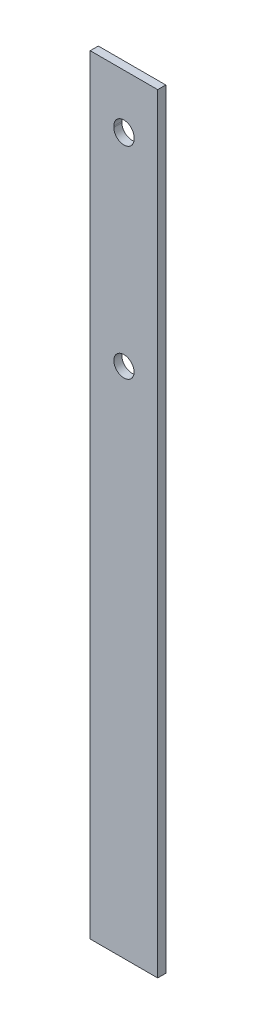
ISO-10303-21;
HEADER;
FILE_DESCRIPTION(('STEP AP214'),'2;1');
FILE_NAME('part.step','',(''),(''),'','','');
FILE_SCHEMA(('AUTOMOTIVE_DESIGN { 1 0 10303 214 1 1 1 1 }'));
ENDSEC;
DATA;
#1=APPLICATION_CONTEXT('core data for automotive mechanical design processes');
#2=APPLICATION_PROTOCOL_DEFINITION('international standard','automotive_design',2000,#1);
#3=PRODUCT_CONTEXT('',#1,'mechanical');
#4=PRODUCT('Part','Part','',(#3));
#5=PRODUCT_RELATED_PRODUCT_CATEGORY('part','',(#4));
#6=PRODUCT_DEFINITION_FORMATION('','',#4);
#7=PRODUCT_DEFINITION_CONTEXT('part definition',#1,'design');
#8=PRODUCT_DEFINITION('design','',#6,#7);
#9=PRODUCT_DEFINITION_SHAPE('','',#8);
#10=(LENGTH_UNIT() NAMED_UNIT(*) SI_UNIT(.MILLI.,.METRE.));
#11=(NAMED_UNIT(*) PLANE_ANGLE_UNIT() SI_UNIT($,.RADIAN.));
#12=(NAMED_UNIT(*) SI_UNIT($,.STERADIAN.) SOLID_ANGLE_UNIT());
#13=UNCERTAINTY_MEASURE_WITH_UNIT(LENGTH_MEASURE(1.E-05),#10,'distance_accuracy_value','');
#14=(GEOMETRIC_REPRESENTATION_CONTEXT(3) GLOBAL_UNCERTAINTY_ASSIGNED_CONTEXT((#13)) GLOBAL_UNIT_ASSIGNED_CONTEXT((#10,
#11,#12)) REPRESENTATION_CONTEXT('',''));
#15=CARTESIAN_POINT('',(0.,0.,0.));
#16=DIRECTION('',(0.,0.,1.));
#17=DIRECTION('',(1.,0.,0.));
#18=AXIS2_PLACEMENT_3D('',#15,#16,#17);
#19=CARTESIAN_POINT('',(-25.,370.,-3.));
#20=DIRECTION('',(0.,0.,1.));
#21=DIRECTION('',(1.,0.,0.));
#22=AXIS2_PLACEMENT_3D('',#19,#20,#21);
#23=PLANE('',#22);
#24=DIRECTION('',(0.,-1.,0.));
#25=VECTOR('',#24,1.);
#26=CARTESIAN_POINT('',(-7.5,329.5,-3.));
#27=LINE('',#26,#25);
#28=CARTESIAN_POINT('',(-7.5,330.5,-3.));
#29=VERTEX_POINT('',#28);
#30=CARTESIAN_POINT('',(-7.5,329.5,-3.));
#31=VERTEX_POINT('',#30);
#32=EDGE_CURVE('E136',#29,#31,#27,.T.);
#33=ORIENTED_EDGE('',*,*,#32,.T.);
#34=CARTESIAN_POINT('',(0.,329.5,-3.));
#35=DIRECTION('',(0.,0.,1.));
#36=DIRECTION('',(1.,0.,0.));
#37=AXIS2_PLACEMENT_3D('',#34,#35,#36);
#38=CIRCLE('',#37,7.5);
#39=CARTESIAN_POINT('',(7.5,329.5,-3.));
#40=VERTEX_POINT('',#39);
#41=EDGE_CURVE('E129',#31,#40,#38,.T.);
#42=ORIENTED_EDGE('',*,*,#41,.T.);
#43=DIRECTION('',(0.,1.,0.));
#44=VECTOR('',#43,1.);
#45=CARTESIAN_POINT('',(7.5,329.5,-3.));
#46=LINE('',#45,#44);
#47=CARTESIAN_POINT('',(7.5,330.5,-3.));
#48=VERTEX_POINT('',#47);
#49=EDGE_CURVE('E132',#40,#48,#46,.T.);
#50=ORIENTED_EDGE('',*,*,#49,.T.);
#51=CARTESIAN_POINT('',(0.,330.5,-3.));
#52=DIRECTION('',(0.,0.,1.));
#53=DIRECTION('',(1.,0.,0.));
#54=AXIS2_PLACEMENT_3D('',#51,#52,#53);
#55=CIRCLE('',#54,7.5);
#56=EDGE_CURVE('E40',#48,#29,#55,.T.);
#57=ORIENTED_EDGE('',*,*,#56,.T.);
#58=EDGE_LOOP('',(#33,#42,#50,#57));
#59=FACE_BOUND('',#58,.T.);
#60=CARTESIAN_POINT('',(0.,180.,-3.));
#61=DIRECTION('',(0.,0.,1.));
#62=DIRECTION('',(1.,0.,0.));
#63=AXIS2_PLACEMENT_3D('',#60,#61,#62);
#64=CIRCLE('',#63,7.5);
#65=CARTESIAN_POINT('',(7.5,180.,-3.));
#66=VERTEX_POINT('',#65);
#67=EDGE_CURVE('E150',#66,#66,#64,.T.);
#68=ORIENTED_EDGE('',*,*,#67,.T.);
#69=EDGE_LOOP('',(#68));
#70=FACE_BOUND('',#69,.T.);
#71=DIRECTION('',(0.,-1.,0.));
#72=VECTOR('',#71,1.);
#73=CARTESIAN_POINT('',(25.,370.,-3.));
#74=LINE('',#73,#72);
#75=CARTESIAN_POINT('',(25.,370.,-3.));
#76=VERTEX_POINT('',#75);
#77=CARTESIAN_POINT('',(25.,-200.,-3.));
#78=VERTEX_POINT('',#77);
#79=EDGE_CURVE('E90',#76,#78,#74,.T.);
#80=ORIENTED_EDGE('',*,*,#79,.T.);
#81=DIRECTION('',(1.,0.,0.));
#82=VECTOR('',#81,1.);
#83=CARTESIAN_POINT('',(-25.,-200.,-3.));
#84=LINE('',#83,#82);
#85=CARTESIAN_POINT('',(-25.,-200.,-3.));
#86=VERTEX_POINT('',#85);
#87=EDGE_CURVE('E94',#86,#78,#84,.T.);
#88=ORIENTED_EDGE('',*,*,#87,.F.);
#89=DIRECTION('',(0.,-1.,0.));
#90=VECTOR('',#89,1.);
#91=CARTESIAN_POINT('',(-25.,370.,-3.));
#92=LINE('',#91,#90);
#93=CARTESIAN_POINT('',(-25.,370.,-3.));
#94=VERTEX_POINT('',#93);
#95=EDGE_CURVE('E11',#94,#86,#92,.T.);
#96=ORIENTED_EDGE('',*,*,#95,.F.);
#97=DIRECTION('',(-1.,0.,0.));
#98=VECTOR('',#97,1.);
#99=CARTESIAN_POINT('',(-25.,370.,-3.));
#100=LINE('',#99,#98);
#101=EDGE_CURVE('E96',#76,#94,#100,.T.);
#102=ORIENTED_EDGE('',*,*,#101,.F.);
#103=EDGE_LOOP('',(#80,#88,#96,#102));
#104=FACE_BOUND('',#103,.T.);
#105=ADVANCED_FACE('F26',(#59,#70,#104),#23,.F.);
#106=CARTESIAN_POINT('',(-25.,370.,-3.));
#107=DIRECTION('',(1.,0.,0.));
#108=DIRECTION('',(0.,0.,-1.));
#109=AXIS2_PLACEMENT_3D('',#106,#107,#108);
#110=PLANE('',#109);
#111=ORIENTED_EDGE('',*,*,#95,.T.);
#112=DIRECTION('',(0.,0.,-1.));
#113=VECTOR('',#112,1.);
#114=CARTESIAN_POINT('',(-25.,-200.,3.));
#115=LINE('',#114,#113);
#116=CARTESIAN_POINT('',(-25.,-200.,3.));
#117=VERTEX_POINT('',#116);
#118=EDGE_CURVE('E114',#117,#86,#115,.T.);
#119=ORIENTED_EDGE('',*,*,#118,.F.);
#120=DIRECTION('',(0.,-1.,0.));
#121=VECTOR('',#120,1.);
#122=CARTESIAN_POINT('',(-25.,370.,3.));
#123=LINE('',#122,#121);
#124=CARTESIAN_POINT('',(-25.,370.,3.));
#125=VERTEX_POINT('',#124);
#126=EDGE_CURVE('E33',#125,#117,#123,.T.);
#127=ORIENTED_EDGE('',*,*,#126,.F.);
#128=DIRECTION('',(0.,0.,1.));
#129=VECTOR('',#128,1.);
#130=CARTESIAN_POINT('',(-25.,370.,-3.));
#131=LINE('',#130,#129);
#132=EDGE_CURVE('E154',#94,#125,#131,.T.);
#133=ORIENTED_EDGE('',*,*,#132,.F.);
#134=EDGE_LOOP('',(#111,#119,#127,#133));
#135=FACE_BOUND('',#134,.T.);
#136=ADVANCED_FACE('F164',(#135),#110,.F.);
#137=CARTESIAN_POINT('',(-25.,370.,3.));
#138=DIRECTION('',(0.,0.,-1.));
#139=DIRECTION('',(-1.,0.,0.));
#140=AXIS2_PLACEMENT_3D('',#137,#138,#139);
#141=PLANE('',#140);
#142=DIRECTION('',(0.,1.,0.));
#143=VECTOR('',#142,1.);
#144=CARTESIAN_POINT('',(7.5,329.5,3.));
#145=LINE('',#144,#143);
#146=CARTESIAN_POINT('',(7.5,329.5,3.));
#147=VERTEX_POINT('',#146);
#148=CARTESIAN_POINT('',(7.5,330.5,3.));
#149=VERTEX_POINT('',#148);
#150=EDGE_CURVE('E120',#147,#149,#145,.T.);
#151=ORIENTED_EDGE('',*,*,#150,.F.);
#152=CARTESIAN_POINT('',(0.,329.5,3.));
#153=DIRECTION('',(0.,0.,1.));
#154=DIRECTION('',(1.,0.,0.));
#155=AXIS2_PLACEMENT_3D('',#152,#153,#154);
#156=CIRCLE('',#155,7.5);
#157=CARTESIAN_POINT('',(-7.5,329.5,3.));
#158=VERTEX_POINT('',#157);
#159=EDGE_CURVE('E48',#158,#147,#156,.T.);
#160=ORIENTED_EDGE('',*,*,#159,.F.);
#161=DIRECTION('',(0.,-1.,0.));
#162=VECTOR('',#161,1.);
#163=CARTESIAN_POINT('',(-7.5,329.5,3.));
#164=LINE('',#163,#162);
#165=CARTESIAN_POINT('',(-7.5,330.5,3.));
#166=VERTEX_POINT('',#165);
#167=EDGE_CURVE('E126',#166,#158,#164,.T.);
#168=ORIENTED_EDGE('',*,*,#167,.F.);
#169=CARTESIAN_POINT('',(0.,330.5,3.));
#170=DIRECTION('',(0.,0.,1.));
#171=DIRECTION('',(1.,0.,0.));
#172=AXIS2_PLACEMENT_3D('',#169,#170,#171);
#173=CIRCLE('',#172,7.5);
#174=EDGE_CURVE('E123',#149,#166,#173,.T.);
#175=ORIENTED_EDGE('',*,*,#174,.F.);
#176=EDGE_LOOP('',(#151,#160,#168,#175));
#177=FACE_BOUND('',#176,.T.);
#178=CARTESIAN_POINT('',(0.,180.,3.));
#179=DIRECTION('',(0.,0.,1.));
#180=DIRECTION('',(1.,0.,0.));
#181=AXIS2_PLACEMENT_3D('',#178,#179,#180);
#182=CIRCLE('',#181,7.5);
#183=CARTESIAN_POINT('',(7.5,180.,3.));
#184=VERTEX_POINT('',#183);
#185=EDGE_CURVE('E142',#184,#184,#182,.T.);
#186=ORIENTED_EDGE('',*,*,#185,.F.);
#187=EDGE_LOOP('',(#186));
#188=FACE_BOUND('',#187,.T.);
#189=ORIENTED_EDGE('',*,*,#126,.T.);
#190=DIRECTION('',(-1.,0.,0.));
#191=VECTOR('',#190,1.);
#192=CARTESIAN_POINT('',(25.,-200.,3.));
#193=LINE('',#192,#191);
#194=CARTESIAN_POINT('',(25.,-200.,3.));
#195=VERTEX_POINT('',#194);
#196=EDGE_CURVE('E109',#195,#117,#193,.T.);
#197=ORIENTED_EDGE('',*,*,#196,.F.);
#198=DIRECTION('',(0.,-1.,0.));
#199=VECTOR('',#198,1.);
#200=CARTESIAN_POINT('',(25.,370.,3.));
#201=LINE('',#200,#199);
#202=CARTESIAN_POINT('',(25.,370.,3.));
#203=VERTEX_POINT('',#202);
#204=EDGE_CURVE('E99',#203,#195,#201,.T.);
#205=ORIENTED_EDGE('',*,*,#204,.F.);
#206=DIRECTION('',(1.,0.,0.));
#207=VECTOR('',#206,1.);
#208=CARTESIAN_POINT('',(-25.,370.,3.));
#209=LINE('',#208,#207);
#210=EDGE_CURVE('E156',#125,#203,#209,.T.);
#211=ORIENTED_EDGE('',*,*,#210,.F.);
#212=EDGE_LOOP('',(#189,#197,#205,#211));
#213=FACE_BOUND('',#212,.T.);
#214=ADVANCED_FACE('F162',(#177,#188,#213),#141,.F.);
#215=CARTESIAN_POINT('',(25.,370.,-3.));
#216=DIRECTION('',(-1.,0.,0.));
#217=DIRECTION('',(0.,0.,1.));
#218=AXIS2_PLACEMENT_3D('',#215,#216,#217);
#219=PLANE('',#218);
#220=ORIENTED_EDGE('',*,*,#204,.T.);
#221=DIRECTION('',(0.,0.,1.));
#222=VECTOR('',#221,1.);
#223=CARTESIAN_POINT('',(25.,-200.,-3.));
#224=LINE('',#223,#222);
#225=EDGE_CURVE('E103',#78,#195,#224,.T.);
#226=ORIENTED_EDGE('',*,*,#225,.F.);
#227=ORIENTED_EDGE('',*,*,#79,.F.);
#228=DIRECTION('',(0.,0.,-1.));
#229=VECTOR('',#228,1.);
#230=CARTESIAN_POINT('',(25.,370.,-3.));
#231=LINE('',#230,#229);
#232=EDGE_CURVE('E100',#203,#76,#231,.T.);
#233=ORIENTED_EDGE('',*,*,#232,.F.);
#234=EDGE_LOOP('',(#220,#226,#227,#233));
#235=FACE_BOUND('',#234,.T.);
#236=ADVANCED_FACE('F104',(#235),#219,.F.);
#237=CARTESIAN_POINT('',(25.,370.,-3.));
#238=DIRECTION('',(0.,-1.,0.));
#239=DIRECTION('',(0.,0.,-1.));
#240=AXIS2_PLACEMENT_3D('',#237,#238,#239);
#241=PLANE('',#240);
#242=ORIENTED_EDGE('',*,*,#101,.T.);
#243=ORIENTED_EDGE('',*,*,#132,.T.);
#244=ORIENTED_EDGE('',*,*,#210,.T.);
#245=ORIENTED_EDGE('',*,*,#232,.T.);
#246=EDGE_LOOP('',(#242,#243,#244,#245));
#247=FACE_BOUND('',#246,.T.);
#248=ADVANCED_FACE('F166',(#247),#241,.F.);
#249=CARTESIAN_POINT('',(0.,180.,-3.));
#250=DIRECTION('',(0.,0.,1.));
#251=DIRECTION('',(1.,0.,0.));
#252=AXIS2_PLACEMENT_3D('',#249,#250,#251);
#253=CYLINDRICAL_SURFACE('',#252,7.5);
#254=ORIENTED_EDGE('',*,*,#67,.F.);
#255=EDGE_LOOP('',(#254));
#256=FACE_BOUND('',#255,.T.);
#257=ORIENTED_EDGE('',*,*,#185,.T.);
#258=EDGE_LOOP('',(#257));
#259=FACE_BOUND('',#258,.T.);
#260=ADVANCED_FACE('F168',(#256,#259),#253,.F.);
#261=CARTESIAN_POINT('',(0.,329.5,-3.));
#262=DIRECTION('',(0.,0.,1.));
#263=DIRECTION('',(1.,0.,0.));
#264=AXIS2_PLACEMENT_3D('',#261,#262,#263);
#265=CYLINDRICAL_SURFACE('',#264,7.5);
#266=DIRECTION('',(0.,0.,1.));
#267=VECTOR('',#266,1.);
#268=CARTESIAN_POINT('',(7.5,329.5,-3.));
#269=LINE('',#268,#267);
#270=EDGE_CURVE('E139',#40,#147,#269,.T.);
#271=ORIENTED_EDGE('',*,*,#270,.F.);
#272=ORIENTED_EDGE('',*,*,#41,.F.);
#273=DIRECTION('',(0.,0.,1.));
#274=VECTOR('',#273,1.);
#275=CARTESIAN_POINT('',(-7.5,329.5,-3.));
#276=LINE('',#275,#274);
#277=EDGE_CURVE('E140',#31,#158,#276,.T.);
#278=ORIENTED_EDGE('',*,*,#277,.T.);
#279=ORIENTED_EDGE('',*,*,#159,.T.);
#280=EDGE_LOOP('',(#271,#272,#278,#279));
#281=FACE_BOUND('',#280,.T.);
#282=ADVANCED_FACE('F173',(#281),#265,.F.);
#283=CARTESIAN_POINT('',(-7.5,329.5,-3.));
#284=DIRECTION('',(-1.,0.,0.));
#285=DIRECTION('',(0.,0.,1.));
#286=AXIS2_PLACEMENT_3D('',#283,#284,#285);
#287=PLANE('',#286);
#288=ORIENTED_EDGE('',*,*,#277,.F.);
#289=ORIENTED_EDGE('',*,*,#32,.F.);
#290=DIRECTION('',(0.,0.,1.));
#291=VECTOR('',#290,1.);
#292=CARTESIAN_POINT('',(-7.5,330.5,-3.));
#293=LINE('',#292,#291);
#294=EDGE_CURVE('E143',#29,#166,#293,.T.);
#295=ORIENTED_EDGE('',*,*,#294,.T.);
#296=ORIENTED_EDGE('',*,*,#167,.T.);
#297=EDGE_LOOP('',(#288,#289,#295,#296));
#298=FACE_BOUND('',#297,.T.);
#299=ADVANCED_FACE('F203',(#298),#287,.F.);
#300=CARTESIAN_POINT('',(0.,330.5,-3.));
#301=DIRECTION('',(0.,0.,1.));
#302=DIRECTION('',(1.,0.,0.));
#303=AXIS2_PLACEMENT_3D('',#300,#301,#302);
#304=CYLINDRICAL_SURFACE('',#303,7.5);
#305=ORIENTED_EDGE('',*,*,#294,.F.);
#306=ORIENTED_EDGE('',*,*,#56,.F.);
#307=DIRECTION('',(0.,0.,1.));
#308=VECTOR('',#307,1.);
#309=CARTESIAN_POINT('',(7.5,330.5,-3.));
#310=LINE('',#309,#308);
#311=EDGE_CURVE('E145',#48,#149,#310,.T.);
#312=ORIENTED_EDGE('',*,*,#311,.T.);
#313=ORIENTED_EDGE('',*,*,#174,.T.);
#314=EDGE_LOOP('',(#305,#306,#312,#313));
#315=FACE_BOUND('',#314,.T.);
#316=ADVANCED_FACE('F204',(#315),#304,.F.);
#317=CARTESIAN_POINT('',(7.5,329.5,-3.));
#318=DIRECTION('',(1.,0.,0.));
#319=DIRECTION('',(0.,0.,-1.));
#320=AXIS2_PLACEMENT_3D('',#317,#318,#319);
#321=PLANE('',#320);
#322=ORIENTED_EDGE('',*,*,#311,.F.);
#323=ORIENTED_EDGE('',*,*,#49,.F.);
#324=ORIENTED_EDGE('',*,*,#270,.T.);
#325=ORIENTED_EDGE('',*,*,#150,.T.);
#326=EDGE_LOOP('',(#322,#323,#324,#325));
#327=FACE_BOUND('',#326,.T.);
#328=ADVANCED_FACE('F199',(#327),#321,.F.);
#329=CARTESIAN_POINT('',(25.,-200.,-3.));
#330=DIRECTION('',(0.,-1.,0.));
#331=DIRECTION('',(0.,0.,-1.));
#332=AXIS2_PLACEMENT_3D('',#329,#330,#331);
#333=PLANE('',#332);
#334=ORIENTED_EDGE('',*,*,#87,.T.);
#335=ORIENTED_EDGE('',*,*,#225,.T.);
#336=ORIENTED_EDGE('',*,*,#196,.T.);
#337=ORIENTED_EDGE('',*,*,#118,.T.);
#338=EDGE_LOOP('',(#334,#335,#336,#337));
#339=FACE_BOUND('',#338,.T.);
#340=ADVANCED_FACE('F112',(#339),#333,.T.);
#341=CLOSED_SHELL('',(#105,#136,#214,#236,#248,#260,#282,#299,#316,#328,#340));
#342=MANIFOLD_SOLID_BREP('B2',#341);
#343=ADVANCED_BREP_SHAPE_REPRESENTATION('',(#18,#342),#14);
#344=SHAPE_DEFINITION_REPRESENTATION(#9,#343);
ENDSEC;
END-ISO-10303-21;
